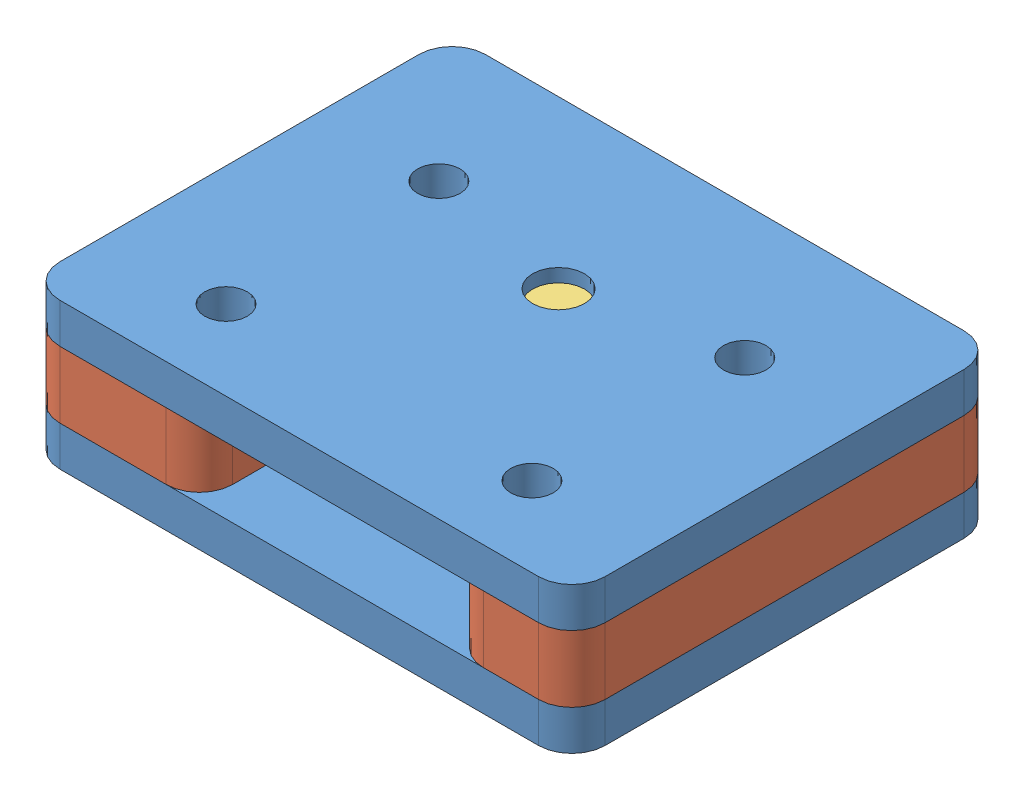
SolidWorks assembly 14G011 - Liaison patin-mors.SLDASM, configuration Défaut (file format 10000). Lengths in mm.
4 component instances, 3 part files, 7 mates.
Components (placement in the parent):
- 14G105 - Plaque ep 6mm support patin-mors-1: 14G105 - Plaque ep 6mm support patin-mors.SLDPRT [Défaut] at (-0.7582 -5.6536 0) size (82 6 64)
- 14G106 - Piece fixation patin biellette-1: 14G106 - Piece fixation patin biellette.SLDPRT [Défaut] at (-0.7582 0.3464 0) size (82 10 64)
- 14G105 - Plaque ep 6mm support patin-mors-2: 14G105 - Plaque ep 6mm support patin-mors.SLDPRT [Défaut] at (-0.7582 10.3464 0) size (82 6 64)
- 14G107 - Axe biellette patin-1: 14G107 - Axe biellette patin.SLDPRT [Défaut] at (-0.7582 -5.6536 -7) size (8 20 8)
Mates (geometry in assembly coordinates):
- Coïncidente1: coincident aligned: plane of 14G105 - Plaque ep 6mm support patin-mors-1 through (40.2418 0.3464 -32) normal (1 0 0); plane of 14G106 - Piece fixation patin biellette-1 through (40.2418 10.3464 -32) normal (1 0 0)
- Coïncidente3: coincident anti-aligned: plane of 14G105 - Plaque ep 6mm support patin-mors-1 through (-41.7582 0.3464 32) normal (0 1 0); plane of 14G106 - Piece fixation patin biellette-1 through (40.2418 0.3464 32) normal (0 -1 0)
- Coïncidente4: coincident aligned: plane of 14G106 - Piece fixation patin biellette-1 through (40.2418 10.3464 -32) normal (1 0 0); plane of 14G105 - Plaque ep 6mm support patin-mors-2 through (40.2418 16.3464 -32) normal (1 0 0)
- Coïncidente6: coincident anti-aligned: plane of 14G106 - Piece fixation patin biellette-1 through (40.2418 10.3464 32) normal (0 1 0); plane of 14G105 - Plaque ep 6mm support patin-mors-2 through (-41.7582 10.3464 32) normal (0 -1 0)
- Coaxiale1: concentric aligned: cylinder of 14G105 - Plaque ep 6mm support patin-mors-1 through (-0.7582 -9.6536 -7) axis (0 1 0) radius 3.9; cylinder of 14G107 - Axe biellette patin-1 through (-0.7582 -9.6536 -7) axis (0 1 0) radius 4
- Coïncidente7: coincident aligned: plane of 14G105 - Plaque ep 6mm support patin-mors-1 through (-41.7582 -5.6536 32) normal (0 -1 0); plane of 14G107 - Axe biellette patin-1 through (-0.7582 -5.6536 -7) normal (0 -1 0)
- Concentric2: concentric aligned: cylinder of 14G105 - Plaque ep 6mm support patin-mors-1 through (-23.7582 -9.6536 -12) axis (0 1 0) radius 3.2; cylinder of 14G106 - Piece fixation patin biellette-1 through (-23.7582 0.3464 -12) axis (0 1 0) radius 3.2
